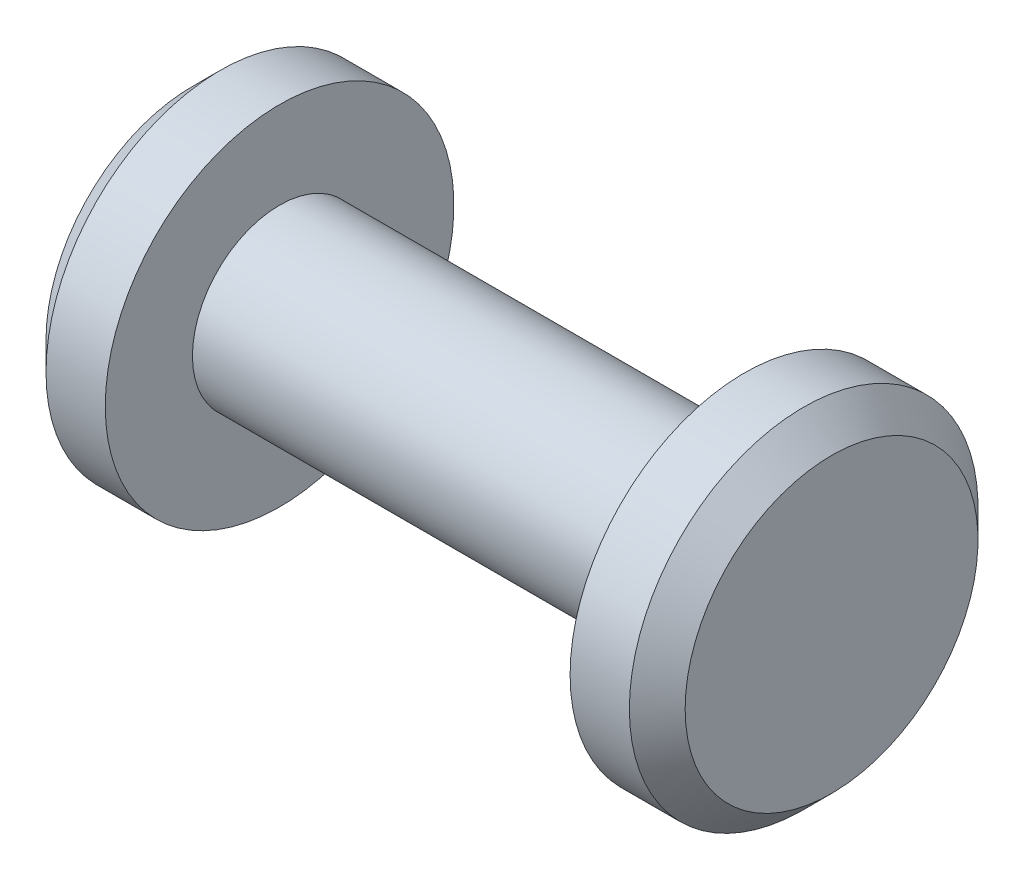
from build123d import *

# Parameters (mm, degrees)
CHAMFER1_SIZE = 0.762


with BuildPart() as part:
    # Sketch1 → Base-Revolve (revolve)
    with BuildSketch(Plane.XY, mode=Mode.PRIVATE) as base_revolve_sk:
        Polygon((8.73125, 0), (8.73125, 4.7625), (6.35, 4.7625), (6.35, 2.38125), (-6.35, 2.38125), (-6.35, 4.7625), (-8.73125, 4.7625), (-8.73125, 0), align=None)
    revolve(base_revolve_sk.sketch.rotate(Axis((0, 0, 0), (1, 0, 0)), 90), axis=Axis((0, 0, 0), (1, 0, 0)))

    # Chamfer1
    chamfer1_edges = [part.edges().sort_by_distance(p)[0] for p in [
        (8.73125, 0, -4.7625),
        (-8.73125, 0, -4.7625),
    ]]
    chamfer(chamfer1_edges, length=CHAMFER1_SIZE)


solid = part.part
